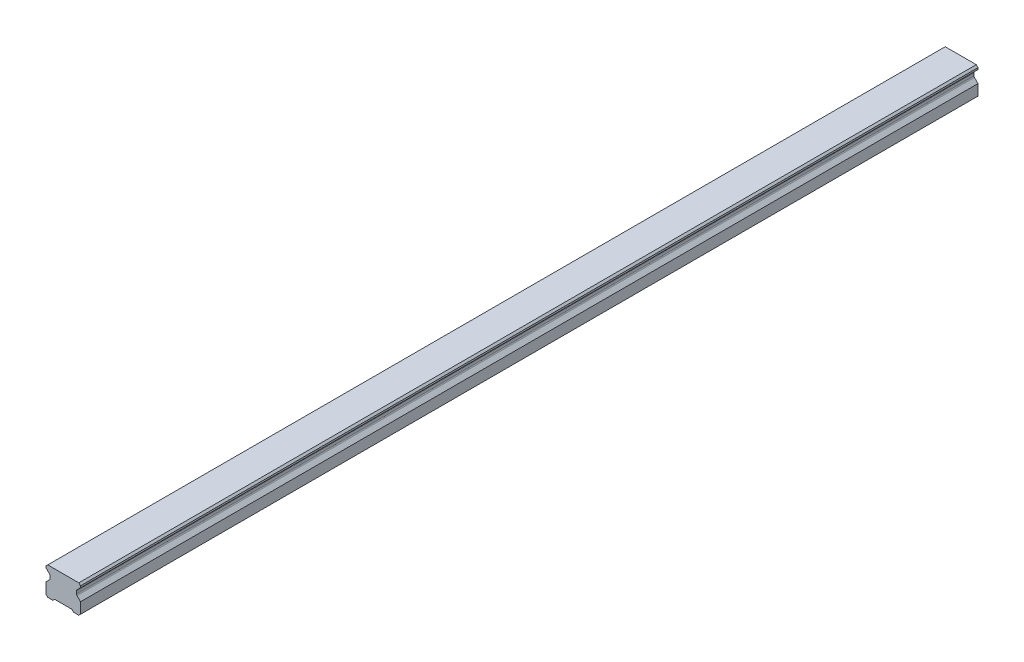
from build123d import *

# Parameters (mm, degrees)
SKETCH1_W           = 20
SKETCH1_H           = 16.3
BOSS_EXTRUDE1_DEPTH = 260
CUT_EXTRUDE1_DEPTH  = 521.351506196
CHAMFER1_SIZE       = 1
FILLET1_R           = 1
CUT_EXTRUDE2_DEPTH  = 521.351506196
SKETCH5_R           = 3
SKETCH5_R_2         = 2.5
CUT_EXTRUDE5_DEPTH  = 10
SKETCH5_2_R         = 2.5
CUT_EXTRUDE6_DEPTH  = 13
LPATTERN2_COUNT     = 9
LPATTERN2_PITCH     = 60


with BuildPart() as part:
    # Sketch1 → Boss-Extrude1 (new, symmetric)
    with BuildSketch(Plane.XY):
        with Locations((0, 8.15)):
            Rectangle(SKETCH1_W, SKETCH1_H)
    extrude(amount=BOSS_EXTRUDE1_DEPTH, both=True)

    # Sketch2 → Cut-Extrude1 (cut, through all)
    with BuildSketch(Plane.XY.offset(260)):
        Polygon((-10, 14.3), (-10, 7.3), (-7.666666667, 9.633333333), (-7.666666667, 11.966666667), align=None)
        Polygon((7.666666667, 11.966666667), (10, 14.3), (10, 7.3), (7.666666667, 9.633333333), align=None)
    extrude(amount=-CUT_EXTRUDE1_DEPTH, mode=Mode.SUBTRACT)

    # Chamfer1
    chamfer1_edges = [part.edges().sort_by_distance(p)[0] for p in [
        (-10, 16.3, 0),
        (10, 16.3, 0),
        (10, 0, 0),
        (-10, 0, 0),
    ]]
    chamfer(chamfer1_edges, length=CHAMFER1_SIZE)

    # Fillet1
    fillet1_edges = [part.edges().sort_by_distance(p)[0] for p in [
        (-7.666666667, 11.966666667, 0),
        (-7.666666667, 9.633333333, 0),
        (7.666666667, 9.633333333, 0),
        (7.666666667, 11.966666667, 0),
    ]]
    fillet(fillet1_edges, radius=FILLET1_R)

    # Sketch3 → Cut-Extrude2 (cut, through all)
    with BuildSketch(Plane.XY.offset(260)):
        Polygon((-6, 0), (-5, 1), (5, 1), (6, 0), align=None)
    extrude(amount=-CUT_EXTRUDE2_DEPTH, mode=Mode.SUBTRACT)

    # Sketch5 → Cut-Extrude5 (cut)
    with BuildSketch(Plane.XZ.offset(-1)):
        with Locations(Location((0, 240, 0), (0, 0, 270))):
            Circle(SKETCH5_R)
        with Locations(Location((0, 240, 0), (0, 0, 270))):
            Circle(SKETCH5_R_2, mode=Mode.SUBTRACT)
    cut_extrude5 = extrude(amount=-CUT_EXTRUDE5_DEPTH, mode=Mode.SUBTRACT)

    # Sketch5_2 → Cut-Extrude6 (cut)
    with BuildSketch(Plane.XZ.offset(-1)):
        with Locations(Location((0, 240, 0), (0, 0, 270))):
            Circle(SKETCH5_2_R)
    cut_extrude6 = extrude(amount=-CUT_EXTRUDE6_DEPTH, mode=Mode.SUBTRACT)

    # Cut-Extrude7 cone 1 section (on through the dimple's axis) → Cut-Extrude7 (revolve, cut)
    with BuildSketch(Plane(origin=(0, 14, 240), x_dir=(0, 0, -1), z_dir=(1, 0, 0))):
        Polygon((0, 0), (2.5, 0), (0, 1.443375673), align=None)
    cut_extrude7 = revolve(axis=Axis((0, 14, 240), (0, 1, 0)), mode=Mode.SUBTRACT)

    # LPattern2: Cut-Extrude5, Cut-Extrude6, Cut-Extrude7 ×9
    with Locations(*[(0, 0, -i * LPATTERN2_PITCH) for i in range(1, LPATTERN2_COUNT)]):
        add(cut_extrude5, mode=Mode.SUBTRACT)
        add(cut_extrude6, mode=Mode.SUBTRACT)
        add(cut_extrude7, mode=Mode.SUBTRACT)


solid = part.part
